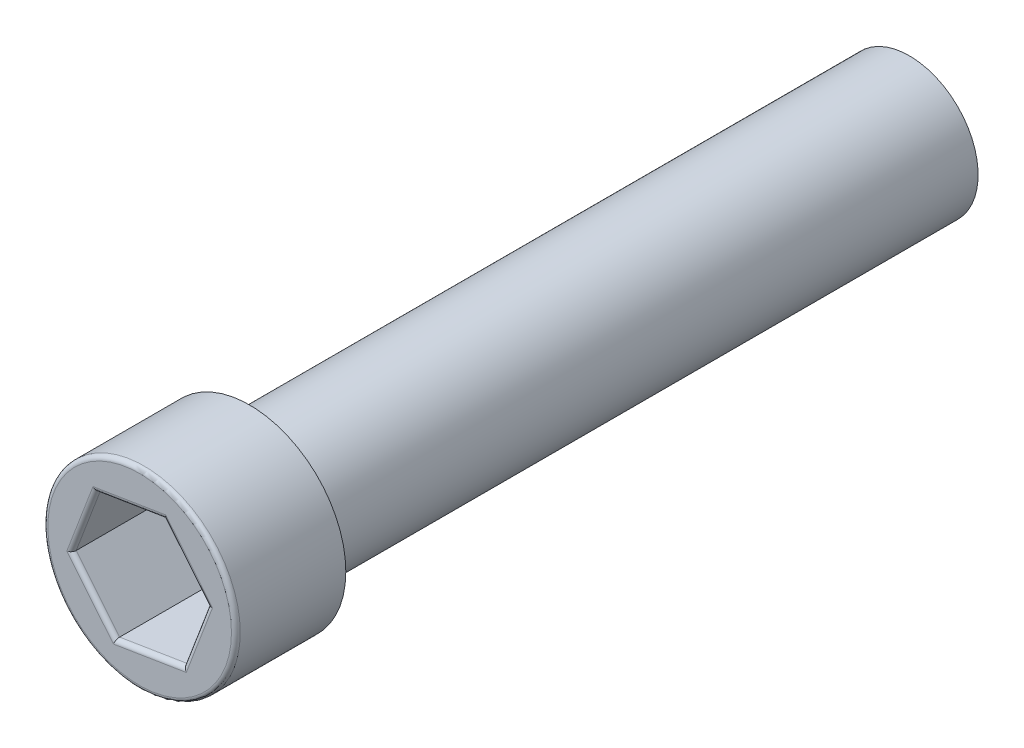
from build123d import *

# Parameters (mm, degrees)
SKETCH1_R           = 3.96875
BOSS_EXTRUDE1_DEPTH = 38.1
SKETCH2_R           = 5.55625
BOSS_EXTRUDE2_DEPTH = 6.35
CUT_EXTRUDE1_DEPTH  = 5.08
FILLET1_R           = 0.254
FILLET2_R           = 0.254


with BuildPart() as part:
    # Sketch1 → Boss-Extrude1 (new body)
    with BuildSketch(Plane.XY):
        with Locations(Location((0, 0, 0), (0, 0, 180))):
            Circle(SKETCH1_R)
    extrude(amount=BOSS_EXTRUDE1_DEPTH)

    # Sketch2 → Boss-Extrude2 (add)
    with BuildSketch(Plane.XY.offset(38.1)):
        Circle(SKETCH2_R)
    extrude(amount=BOSS_EXTRUDE2_DEPTH)

    # Sketch3 → Cut-Extrude1 (cut)
    with BuildSketch(Plane.XY.offset(44.45)):
        Polygon((-3.917486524, -0.635826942), (-2.509385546, 3.074729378), (1.408100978, 3.710556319), (3.917486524, 0.635826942), (2.509385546, -3.074729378), (-1.408100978, -3.710556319), align=None)
    extrude(amount=-CUT_EXTRUDE1_DEPTH, mode=Mode.SUBTRACT)

    # Fillet1
    fillet1_edges = [part.edges().sort_by_distance(p)[0] for p in [
        (-5.55625, 0, 44.45),
    ]]
    fillet(fillet1_edges, radius=FILLET1_R)

    # Fillet2
    fillet2_edges = [part.edges().sort_by_distance(p)[0] for p in [
        (-3.213436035, 1.219451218, 44.45),
        (-0.550642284, 3.392642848, 44.45),
        (2.662793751, 2.173191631, 44.45),
        (3.213436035, -1.219451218, 44.45),
        (0.550642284, -3.392642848, 44.45),
        (-2.662793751, -2.173191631, 44.45),
    ]]
    fillet(fillet2_edges, radius=FILLET2_R)


solid = part.part
